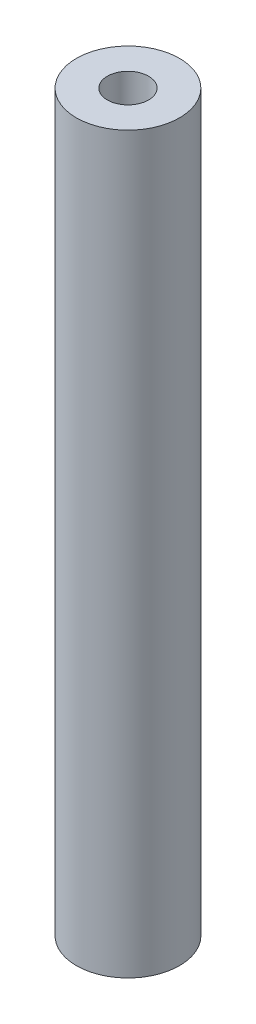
ISO-10303-21;
HEADER;
FILE_DESCRIPTION(('STEP AP214'),'2;1');
FILE_NAME('part.step','',(''),(''),'','','');
FILE_SCHEMA(('AUTOMOTIVE_DESIGN { 1 0 10303 214 1 1 1 1 }'));
ENDSEC;
DATA;
#1=APPLICATION_CONTEXT('core data for automotive mechanical design processes');
#2=APPLICATION_PROTOCOL_DEFINITION('international standard','automotive_design',2000,#1);
#3=PRODUCT_CONTEXT('',#1,'mechanical');
#4=PRODUCT('Part','Part','',(#3));
#5=PRODUCT_RELATED_PRODUCT_CATEGORY('part','',(#4));
#6=PRODUCT_DEFINITION_FORMATION('','',#4);
#7=PRODUCT_DEFINITION_CONTEXT('part definition',#1,'design');
#8=PRODUCT_DEFINITION('design','',#6,#7);
#9=PRODUCT_DEFINITION_SHAPE('','',#8);
#10=(LENGTH_UNIT() NAMED_UNIT(*) SI_UNIT(.MILLI.,.METRE.));
#11=(NAMED_UNIT(*) PLANE_ANGLE_UNIT() SI_UNIT($,.RADIAN.));
#12=(NAMED_UNIT(*) SI_UNIT($,.STERADIAN.) SOLID_ANGLE_UNIT());
#13=UNCERTAINTY_MEASURE_WITH_UNIT(LENGTH_MEASURE(1.E-05),#10,'distance_accuracy_value','');
#14=(GEOMETRIC_REPRESENTATION_CONTEXT(3) GLOBAL_UNCERTAINTY_ASSIGNED_CONTEXT((#13)) GLOBAL_UNIT_ASSIGNED_CONTEXT((#10,
#11,#12)) REPRESENTATION_CONTEXT('',''));
#15=CARTESIAN_POINT('',(0.,0.,0.));
#16=DIRECTION('',(0.,0.,1.));
#17=DIRECTION('',(1.,0.,0.));
#18=AXIS2_PLACEMENT_3D('',#15,#16,#17);
#19=CARTESIAN_POINT('',(0.,89.,0.));
#20=DIRECTION('',(0.,-1.,0.));
#21=DIRECTION('',(0.,0.,-1.));
#22=AXIS2_PLACEMENT_3D('',#19,#20,#21);
#23=CYLINDRICAL_SURFACE('',#22,6.25);
#24=CARTESIAN_POINT('',(0.,89.,0.));
#25=DIRECTION('',(0.,1.,0.));
#26=DIRECTION('',(0.,0.,1.));
#27=AXIS2_PLACEMENT_3D('',#24,#25,#26);
#28=CIRCLE('',#27,6.25);
#29=CARTESIAN_POINT('',(0.,89.,6.25));
#30=VERTEX_POINT('',#29);
#31=EDGE_CURVE('E10',#30,#30,#28,.T.);
#32=ORIENTED_EDGE('',*,*,#31,.F.);
#33=EDGE_LOOP('',(#32));
#34=FACE_BOUND('',#33,.T.);
#35=CARTESIAN_POINT('',(0.,0.,0.));
#36=DIRECTION('',(0.,1.,0.));
#37=DIRECTION('',(0.,0.,1.));
#38=AXIS2_PLACEMENT_3D('',#35,#36,#37);
#39=CIRCLE('',#38,6.25);
#40=CARTESIAN_POINT('',(0.,0.,6.25));
#41=VERTEX_POINT('',#40);
#42=EDGE_CURVE('E41',#41,#41,#39,.T.);
#43=ORIENTED_EDGE('',*,*,#42,.T.);
#44=EDGE_LOOP('',(#43));
#45=FACE_BOUND('',#44,.T.);
#46=ADVANCED_FACE('F38',(#34,#45),#23,.T.);
#47=CARTESIAN_POINT('',(0.,89.,0.));
#48=DIRECTION('',(0.,1.,0.));
#49=DIRECTION('',(0.,0.,1.));
#50=AXIS2_PLACEMENT_3D('',#47,#48,#49);
#51=PLANE('',#50);
#52=CARTESIAN_POINT('',(0.,89.,0.));
#53=DIRECTION('',(0.,1.,0.));
#54=DIRECTION('',(0.,0.,1.));
#55=AXIS2_PLACEMENT_3D('',#52,#53,#54);
#56=CIRCLE('',#55,2.5);
#57=CARTESIAN_POINT('',(0.,89.,2.5));
#58=VERTEX_POINT('',#57);
#59=EDGE_CURVE('E50',#58,#58,#56,.T.);
#60=ORIENTED_EDGE('',*,*,#59,.F.);
#61=EDGE_LOOP('',(#60));
#62=FACE_BOUND('',#61,.T.);
#63=ORIENTED_EDGE('',*,*,#31,.T.);
#64=EDGE_LOOP('',(#63));
#65=FACE_BOUND('',#64,.T.);
#66=ADVANCED_FACE('F75',(#62,#65),#51,.T.);
#67=CARTESIAN_POINT('',(0.,0.,0.));
#68=DIRECTION('',(0.,1.,0.));
#69=DIRECTION('',(0.,0.,1.));
#70=AXIS2_PLACEMENT_3D('',#67,#68,#69);
#71=PLANE('',#70);
#72=CARTESIAN_POINT('',(0.,0.,0.));
#73=DIRECTION('',(0.,-1.,0.));
#74=DIRECTION('',(0.,0.,-1.));
#75=AXIS2_PLACEMENT_3D('',#72,#73,#74);
#76=CIRCLE('',#75,2.5);
#77=CARTESIAN_POINT('',(0.,0.,-2.5));
#78=VERTEX_POINT('',#77);
#79=EDGE_CURVE('E56',#78,#78,#76,.T.);
#80=ORIENTED_EDGE('',*,*,#79,.F.);
#81=EDGE_LOOP('',(#80));
#82=FACE_BOUND('',#81,.T.);
#83=ORIENTED_EDGE('',*,*,#42,.F.);
#84=EDGE_LOOP('',(#83));
#85=FACE_BOUND('',#84,.T.);
#86=ADVANCED_FACE('F71',(#82,#85),#71,.F.);
#87=CARTESIAN_POINT('',(0.,79.,0.));
#88=DIRECTION('',(0.,1.,0.));
#89=DIRECTION('',(0.,0.,1.));
#90=AXIS2_PLACEMENT_3D('',#87,#88,#89);
#91=CYLINDRICAL_SURFACE('',#90,2.5);
#92=CARTESIAN_POINT('',(0.,79.,0.));
#93=DIRECTION('',(0.,1.,0.));
#94=DIRECTION('',(0.,0.,1.));
#95=AXIS2_PLACEMENT_3D('',#92,#93,#94);
#96=CIRCLE('',#95,2.5);
#97=CARTESIAN_POINT('',(0.,79.,2.5));
#98=VERTEX_POINT('',#97);
#99=EDGE_CURVE('E48',#98,#98,#96,.T.);
#100=ORIENTED_EDGE('',*,*,#99,.F.);
#101=EDGE_LOOP('',(#100));
#102=FACE_BOUND('',#101,.T.);
#103=ORIENTED_EDGE('',*,*,#59,.T.);
#104=EDGE_LOOP('',(#103));
#105=FACE_BOUND('',#104,.T.);
#106=ADVANCED_FACE('F74',(#102,#105),#91,.F.);
#107=CARTESIAN_POINT('',(0.,79.,0.));
#108=DIRECTION('',(0.,1.,0.));
#109=DIRECTION('',(0.,0.,1.));
#110=AXIS2_PLACEMENT_3D('',#107,#108,#109);
#111=PLANE('',#110);
#112=ORIENTED_EDGE('',*,*,#99,.T.);
#113=EDGE_LOOP('',(#112));
#114=FACE_BOUND('',#113,.T.);
#115=ADVANCED_FACE('F67',(#114),#111,.T.);
#116=CARTESIAN_POINT('',(0.,10.,0.));
#117=DIRECTION('',(0.,-1.,0.));
#118=DIRECTION('',(0.,0.,-1.));
#119=AXIS2_PLACEMENT_3D('',#116,#117,#118);
#120=CYLINDRICAL_SURFACE('',#119,2.5);
#121=CARTESIAN_POINT('',(0.,10.,0.));
#122=DIRECTION('',(0.,-1.,0.));
#123=DIRECTION('',(0.,0.,-1.));
#124=AXIS2_PLACEMENT_3D('',#121,#122,#123);
#125=CIRCLE('',#124,2.5);
#126=CARTESIAN_POINT('',(0.,10.,-2.5));
#127=VERTEX_POINT('',#126);
#128=EDGE_CURVE('E53',#127,#127,#125,.T.);
#129=ORIENTED_EDGE('',*,*,#128,.F.);
#130=EDGE_LOOP('',(#129));
#131=FACE_BOUND('',#130,.T.);
#132=ORIENTED_EDGE('',*,*,#79,.T.);
#133=EDGE_LOOP('',(#132));
#134=FACE_BOUND('',#133,.T.);
#135=ADVANCED_FACE('F64',(#131,#134),#120,.F.);
#136=CARTESIAN_POINT('',(0.,10.,0.));
#137=DIRECTION('',(0.,-1.,0.));
#138=DIRECTION('',(0.,0.,-1.));
#139=AXIS2_PLACEMENT_3D('',#136,#137,#138);
#140=PLANE('',#139);
#141=ORIENTED_EDGE('',*,*,#128,.T.);
#142=EDGE_LOOP('',(#141));
#143=FACE_BOUND('',#142,.T.);
#144=ADVANCED_FACE('F62',(#143),#140,.T.);
#145=CLOSED_SHELL('',(#46,#66,#86,#106,#115,#135,#144));
#146=MANIFOLD_SOLID_BREP('B2',#145);
#147=ADVANCED_BREP_SHAPE_REPRESENTATION('',(#18,#146),#14);
#148=SHAPE_DEFINITION_REPRESENTATION(#9,#147);
ENDSEC;
END-ISO-10303-21;
